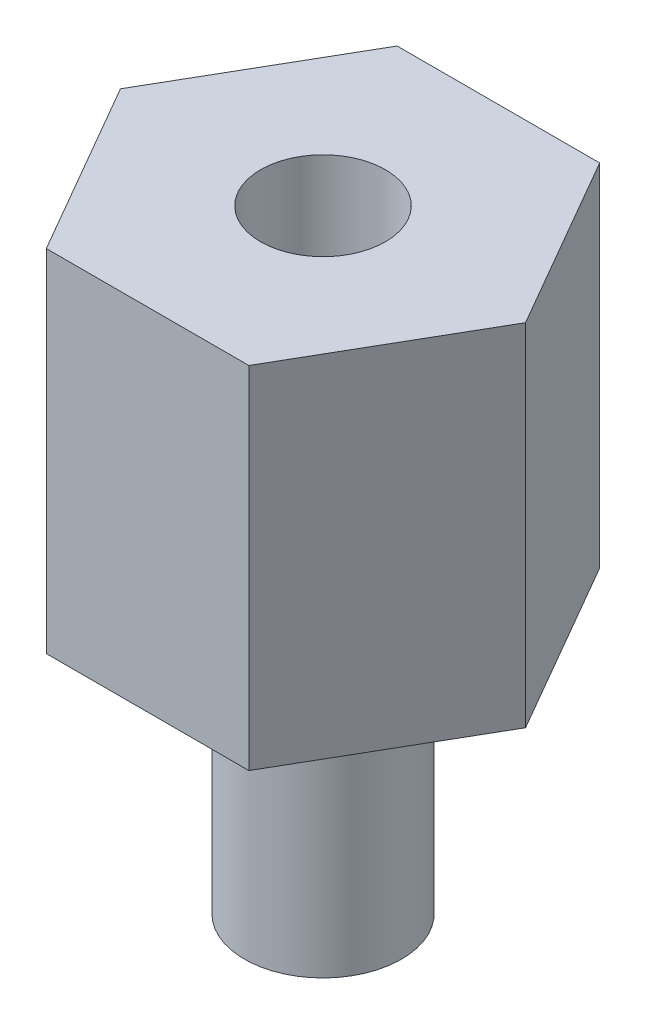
ISO-10303-21;
HEADER;
FILE_DESCRIPTION(('STEP AP214'),'2;1');
FILE_NAME('part.step','',(''),(''),'','','');
FILE_SCHEMA(('AUTOMOTIVE_DESIGN { 1 0 10303 214 1 1 1 1 }'));
ENDSEC;
DATA;
#1=APPLICATION_CONTEXT('core data for automotive mechanical design processes');
#2=APPLICATION_PROTOCOL_DEFINITION('international standard','automotive_design',2000,#1);
#3=PRODUCT_CONTEXT('',#1,'mechanical');
#4=PRODUCT('Part','Part','',(#3));
#5=PRODUCT_RELATED_PRODUCT_CATEGORY('part','',(#4));
#6=PRODUCT_DEFINITION_FORMATION('','',#4);
#7=PRODUCT_DEFINITION_CONTEXT('part definition',#1,'design');
#8=PRODUCT_DEFINITION('design','',#6,#7);
#9=PRODUCT_DEFINITION_SHAPE('','',#8);
#10=(LENGTH_UNIT() NAMED_UNIT(*) SI_UNIT(.MILLI.,.METRE.));
#11=(NAMED_UNIT(*) PLANE_ANGLE_UNIT() SI_UNIT($,.RADIAN.));
#12=(NAMED_UNIT(*) SI_UNIT($,.STERADIAN.) SOLID_ANGLE_UNIT());
#13=UNCERTAINTY_MEASURE_WITH_UNIT(LENGTH_MEASURE(1.E-05),#10,'distance_accuracy_value','');
#14=(GEOMETRIC_REPRESENTATION_CONTEXT(3) GLOBAL_UNCERTAINTY_ASSIGNED_CONTEXT((#13)) GLOBAL_UNIT_ASSIGNED_CONTEXT((#10,
#11,#12)) REPRESENTATION_CONTEXT('',''));
#15=CARTESIAN_POINT('',(0.,0.,0.));
#16=DIRECTION('',(0.,0.,1.));
#17=DIRECTION('',(1.,0.,0.));
#18=AXIS2_PLACEMENT_3D('',#15,#16,#17);
#19=CARTESIAN_POINT('',(1.83308710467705,0.,3.17500000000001));
#20=DIRECTION('',(0.,-1.,0.));
#21=DIRECTION('',(0.,0.,-1.));
#22=AXIS2_PLACEMENT_3D('',#19,#20,#21);
#23=PLANE('',#22);
#24=DIRECTION('',(0.5,0.,-0.866025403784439));
#25=VECTOR('',#24,1.);
#26=CARTESIAN_POINT('',(1.83308710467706,0.,3.17500000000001));
#27=LINE('',#26,#25);
#28=CARTESIAN_POINT('',(1.83308710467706,0.,3.17500000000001));
#29=VERTEX_POINT('',#28);
#30=CARTESIAN_POINT('',(3.66617420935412,0.,0.));
#31=VERTEX_POINT('',#30);
#32=EDGE_CURVE('E125',#29,#31,#27,.T.);
#33=ORIENTED_EDGE('',*,*,#32,.F.);
#34=DIRECTION('',(1.,0.,0.));
#35=VECTOR('',#34,1.);
#36=CARTESIAN_POINT('',(-1.83308710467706,0.,3.175));
#37=LINE('',#36,#35);
#38=CARTESIAN_POINT('',(-1.83308710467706,0.,3.175));
#39=VERTEX_POINT('',#38);
#40=EDGE_CURVE('E85',#39,#29,#37,.T.);
#41=ORIENTED_EDGE('',*,*,#40,.F.);
#42=DIRECTION('',(0.5,0.,0.866025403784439));
#43=VECTOR('',#42,1.);
#44=CARTESIAN_POINT('',(-3.66617420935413,0.,0.));
#45=LINE('',#44,#43);
#46=CARTESIAN_POINT('',(-3.66617420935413,0.,0.));
#47=VERTEX_POINT('',#46);
#48=EDGE_CURVE('E79',#47,#39,#45,.T.);
#49=ORIENTED_EDGE('',*,*,#48,.F.);
#50=DIRECTION('',(-0.499999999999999,0.,0.866025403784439));
#51=VECTOR('',#50,1.);
#52=CARTESIAN_POINT('',(-1.83308710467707,0.,-3.17500000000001));
#53=LINE('',#52,#51);
#54=CARTESIAN_POINT('',(-1.83308710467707,0.,-3.17500000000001));
#55=VERTEX_POINT('',#54);
#56=EDGE_CURVE('E115',#55,#47,#53,.T.);
#57=ORIENTED_EDGE('',*,*,#56,.F.);
#58=DIRECTION('',(-1.,0.,0.));
#59=VECTOR('',#58,1.);
#60=CARTESIAN_POINT('',(1.83308710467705,0.,-3.17500000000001));
#61=LINE('',#60,#59);
#62=CARTESIAN_POINT('',(1.83308710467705,0.,-3.17500000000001));
#63=VERTEX_POINT('',#62);
#64=EDGE_CURVE('E131',#63,#55,#61,.T.);
#65=ORIENTED_EDGE('',*,*,#64,.F.);
#66=DIRECTION('',(-0.500000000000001,0.,-0.866025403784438));
#67=VECTOR('',#66,1.);
#68=CARTESIAN_POINT('',(3.66617420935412,0.,0.));
#69=LINE('',#68,#67);
#70=EDGE_CURVE('E128',#31,#63,#69,.T.);
#71=ORIENTED_EDGE('',*,*,#70,.F.);
#72=EDGE_LOOP('',(#33,#41,#49,#57,#65,#71));
#73=FACE_BOUND('',#72,.T.);
#74=CARTESIAN_POINT('',(0.,0.,0.));
#75=DIRECTION('',(0.,-1.,0.));
#76=DIRECTION('',(0.,0.,-1.));
#77=AXIS2_PLACEMENT_3D('',#74,#75,#76);
#78=CIRCLE('',#77,1.4224);
#79=CARTESIAN_POINT('',(0.,0.,-1.4224));
#80=VERTEX_POINT('',#79);
#81=EDGE_CURVE('E191',#80,#80,#78,.T.);
#82=ORIENTED_EDGE('',*,*,#81,.F.);
#83=EDGE_LOOP('',(#82));
#84=FACE_BOUND('',#83,.T.);
#85=ADVANCED_FACE('F38',(#73,#84),#23,.T.);
#86=CARTESIAN_POINT('',(1.83308710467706,6.35000000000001,3.17500000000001));
#87=DIRECTION('',(-0.866025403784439,0.,-0.5));
#88=DIRECTION('',(-0.5,0.,0.866025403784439));
#89=AXIS2_PLACEMENT_3D('',#86,#87,#88);
#90=PLANE('',#89);
#91=ORIENTED_EDGE('',*,*,#32,.T.);
#92=DIRECTION('',(0.,-1.,0.));
#93=VECTOR('',#92,1.);
#94=CARTESIAN_POINT('',(3.66617420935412,6.35000000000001,0.));
#95=LINE('',#94,#93);
#96=CARTESIAN_POINT('',(3.66617420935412,6.35000000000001,0.));
#97=VERTEX_POINT('',#96);
#98=EDGE_CURVE('E11',#97,#31,#95,.T.);
#99=ORIENTED_EDGE('',*,*,#98,.F.);
#100=DIRECTION('',(0.5,0.,-0.866025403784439));
#101=VECTOR('',#100,1.);
#102=CARTESIAN_POINT('',(1.83308710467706,6.35000000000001,3.17500000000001));
#103=LINE('',#102,#101);
#104=CARTESIAN_POINT('',(1.83308710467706,6.35000000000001,3.17500000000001));
#105=VERTEX_POINT('',#104);
#106=EDGE_CURVE('E136',#105,#97,#103,.T.);
#107=ORIENTED_EDGE('',*,*,#106,.F.);
#108=DIRECTION('',(0.,-1.,0.));
#109=VECTOR('',#108,1.);
#110=CARTESIAN_POINT('',(1.83308710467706,6.35000000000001,3.17500000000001));
#111=LINE('',#110,#109);
#112=EDGE_CURVE('E121',#105,#29,#111,.T.);
#113=ORIENTED_EDGE('',*,*,#112,.T.);
#114=EDGE_LOOP('',(#91,#99,#107,#113));
#115=FACE_BOUND('',#114,.T.);
#116=ADVANCED_FACE('F40',(#115),#90,.F.);
#117=CARTESIAN_POINT('',(3.66617420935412,6.35000000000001,0.));
#118=DIRECTION('',(-0.866025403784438,0.,0.500000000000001));
#119=DIRECTION('',(0.500000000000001,0.,0.866025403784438));
#120=AXIS2_PLACEMENT_3D('',#117,#118,#119);
#121=PLANE('',#120);
#122=ORIENTED_EDGE('',*,*,#70,.T.);
#123=DIRECTION('',(0.,-1.,0.));
#124=VECTOR('',#123,1.);
#125=CARTESIAN_POINT('',(1.83308710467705,6.35000000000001,-3.17500000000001));
#126=LINE('',#125,#124);
#127=CARTESIAN_POINT('',(1.83308710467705,6.35000000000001,-3.17500000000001));
#128=VERTEX_POINT('',#127);
#129=EDGE_CURVE('E47',#128,#63,#126,.T.);
#130=ORIENTED_EDGE('',*,*,#129,.F.);
#131=DIRECTION('',(-0.500000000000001,0.,-0.866025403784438));
#132=VECTOR('',#131,1.);
#133=CARTESIAN_POINT('',(3.66617420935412,6.35000000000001,0.));
#134=LINE('',#133,#132);
#135=EDGE_CURVE('E93',#97,#128,#134,.T.);
#136=ORIENTED_EDGE('',*,*,#135,.F.);
#137=ORIENTED_EDGE('',*,*,#98,.T.);
#138=EDGE_LOOP('',(#122,#130,#136,#137));
#139=FACE_BOUND('',#138,.T.);
#140=ADVANCED_FACE('F165',(#139),#121,.F.);
#141=CARTESIAN_POINT('',(1.83308710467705,6.35000000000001,-3.17500000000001));
#142=DIRECTION('',(0.,0.,1.));
#143=DIRECTION('',(1.,0.,0.));
#144=AXIS2_PLACEMENT_3D('',#141,#142,#143);
#145=PLANE('',#144);
#146=ORIENTED_EDGE('',*,*,#64,.T.);
#147=DIRECTION('',(0.,-1.,0.));
#148=VECTOR('',#147,1.);
#149=CARTESIAN_POINT('',(-1.83308710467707,6.35000000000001,-3.17500000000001));
#150=LINE('',#149,#148);
#151=CARTESIAN_POINT('',(-1.83308710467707,6.35000000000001,-3.17500000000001));
#152=VERTEX_POINT('',#151);
#153=EDGE_CURVE('E116',#152,#55,#150,.T.);
#154=ORIENTED_EDGE('',*,*,#153,.F.);
#155=DIRECTION('',(-1.,0.,0.));
#156=VECTOR('',#155,1.);
#157=CARTESIAN_POINT('',(1.83308710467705,6.35000000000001,-3.17500000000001));
#158=LINE('',#157,#156);
#159=EDGE_CURVE('E107',#128,#152,#158,.T.);
#160=ORIENTED_EDGE('',*,*,#159,.F.);
#161=ORIENTED_EDGE('',*,*,#129,.T.);
#162=EDGE_LOOP('',(#146,#154,#160,#161));
#163=FACE_BOUND('',#162,.T.);
#164=ADVANCED_FACE('F142',(#163),#145,.F.);
#165=CARTESIAN_POINT('',(-1.83308710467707,6.35000000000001,-3.17500000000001));
#166=DIRECTION('',(0.866025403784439,0.,0.499999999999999));
#167=DIRECTION('',(0.499999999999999,0.,-0.866025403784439));
#168=AXIS2_PLACEMENT_3D('',#165,#166,#167);
#169=PLANE('',#168);
#170=ORIENTED_EDGE('',*,*,#56,.T.);
#171=DIRECTION('',(0.,-1.,0.));
#172=VECTOR('',#171,1.);
#173=CARTESIAN_POINT('',(-3.66617420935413,6.35000000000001,0.));
#174=LINE('',#173,#172);
#175=CARTESIAN_POINT('',(-3.66617420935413,6.35000000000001,0.));
#176=VERTEX_POINT('',#175);
#177=EDGE_CURVE('E112',#176,#47,#174,.T.);
#178=ORIENTED_EDGE('',*,*,#177,.F.);
#179=DIRECTION('',(-0.499999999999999,0.,0.866025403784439));
#180=VECTOR('',#179,1.);
#181=CARTESIAN_POINT('',(-1.83308710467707,6.35000000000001,-3.17500000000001));
#182=LINE('',#181,#180);
#183=EDGE_CURVE('E101',#152,#176,#182,.T.);
#184=ORIENTED_EDGE('',*,*,#183,.F.);
#185=ORIENTED_EDGE('',*,*,#153,.T.);
#186=EDGE_LOOP('',(#170,#178,#184,#185));
#187=FACE_BOUND('',#186,.T.);
#188=ADVANCED_FACE('F113',(#187),#169,.F.);
#189=CARTESIAN_POINT('',(-3.66617420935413,6.35000000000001,0.));
#190=DIRECTION('',(0.866025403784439,0.,-0.5));
#191=DIRECTION('',(-0.5,0.,-0.866025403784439));
#192=AXIS2_PLACEMENT_3D('',#189,#190,#191);
#193=PLANE('',#192);
#194=ORIENTED_EDGE('',*,*,#48,.T.);
#195=DIRECTION('',(0.,-1.,0.));
#196=VECTOR('',#195,1.);
#197=CARTESIAN_POINT('',(-1.83308710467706,6.35000000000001,3.175));
#198=LINE('',#197,#196);
#199=CARTESIAN_POINT('',(-1.83308710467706,6.35000000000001,3.175));
#200=VERTEX_POINT('',#199);
#201=EDGE_CURVE('E117',#200,#39,#198,.T.);
#202=ORIENTED_EDGE('',*,*,#201,.F.);
#203=DIRECTION('',(0.5,0.,0.866025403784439));
#204=VECTOR('',#203,1.);
#205=CARTESIAN_POINT('',(-3.66617420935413,6.35000000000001,0.));
#206=LINE('',#205,#204);
#207=EDGE_CURVE('E105',#176,#200,#206,.T.);
#208=ORIENTED_EDGE('',*,*,#207,.F.);
#209=ORIENTED_EDGE('',*,*,#177,.T.);
#210=EDGE_LOOP('',(#194,#202,#208,#209));
#211=FACE_BOUND('',#210,.T.);
#212=ADVANCED_FACE('F119',(#211),#193,.F.);
#213=CARTESIAN_POINT('',(-1.83308710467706,6.35000000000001,3.175));
#214=DIRECTION('',(0.,0.,-1.));
#215=DIRECTION('',(-1.,0.,0.));
#216=AXIS2_PLACEMENT_3D('',#213,#214,#215);
#217=PLANE('',#216);
#218=ORIENTED_EDGE('',*,*,#40,.T.);
#219=ORIENTED_EDGE('',*,*,#112,.F.);
#220=DIRECTION('',(1.,0.,0.));
#221=VECTOR('',#220,1.);
#222=CARTESIAN_POINT('',(-1.83308710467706,6.35000000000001,3.175));
#223=LINE('',#222,#221);
#224=EDGE_CURVE('E55',#200,#105,#223,.T.);
#225=ORIENTED_EDGE('',*,*,#224,.F.);
#226=ORIENTED_EDGE('',*,*,#201,.T.);
#227=EDGE_LOOP('',(#218,#219,#225,#226));
#228=FACE_BOUND('',#227,.T.);
#229=ADVANCED_FACE('F149',(#228),#217,.F.);
#230=CARTESIAN_POINT('',(1.83308710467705,6.35000000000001,3.17500000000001));
#231=DIRECTION('',(0.,-1.,0.));
#232=DIRECTION('',(0.,0.,-1.));
#233=AXIS2_PLACEMENT_3D('',#230,#231,#232);
#234=PLANE('',#233);
#235=CARTESIAN_POINT('',(0.,6.35000000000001,0.));
#236=DIRECTION('',(0.,1.,0.));
#237=DIRECTION('',(0.,0.,1.));
#238=AXIS2_PLACEMENT_3D('',#235,#236,#237);
#239=CIRCLE('',#238,1.1303);
#240=CARTESIAN_POINT('',(0.,6.35000000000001,1.1303));
#241=VERTEX_POINT('',#240);
#242=EDGE_CURVE('E188',#241,#241,#239,.T.);
#243=ORIENTED_EDGE('',*,*,#242,.F.);
#244=EDGE_LOOP('',(#243));
#245=FACE_BOUND('',#244,.T.);
#246=ORIENTED_EDGE('',*,*,#106,.T.);
#247=ORIENTED_EDGE('',*,*,#135,.T.);
#248=ORIENTED_EDGE('',*,*,#159,.T.);
#249=ORIENTED_EDGE('',*,*,#183,.T.);
#250=ORIENTED_EDGE('',*,*,#207,.T.);
#251=ORIENTED_EDGE('',*,*,#224,.T.);
#252=EDGE_LOOP('',(#246,#247,#248,#249,#250,#251));
#253=FACE_BOUND('',#252,.T.);
#254=ADVANCED_FACE('F103',(#245,#253),#234,.F.);
#255=CARTESIAN_POINT('',(0.,-4.7498,0.));
#256=DIRECTION('',(0.,1.,0.));
#257=DIRECTION('',(0.,0.,1.));
#258=AXIS2_PLACEMENT_3D('',#255,#256,#257);
#259=CYLINDRICAL_SURFACE('',#258,1.4224);
#260=CARTESIAN_POINT('',(0.,-4.7498,0.));
#261=DIRECTION('',(0.,-1.,0.));
#262=DIRECTION('',(0.,0.,-1.));
#263=AXIS2_PLACEMENT_3D('',#260,#261,#262);
#264=CIRCLE('',#263,1.4224);
#265=CARTESIAN_POINT('',(0.,-4.7498,-1.4224));
#266=VERTEX_POINT('',#265);
#267=EDGE_CURVE('E129',#266,#266,#264,.T.);
#268=ORIENTED_EDGE('',*,*,#267,.F.);
#269=EDGE_LOOP('',(#268));
#270=FACE_BOUND('',#269,.T.);
#271=ORIENTED_EDGE('',*,*,#81,.T.);
#272=EDGE_LOOP('',(#271));
#273=FACE_BOUND('',#272,.T.);
#274=ADVANCED_FACE('F156',(#270,#273),#259,.T.);
#275=CARTESIAN_POINT('',(0.,-4.7498,0.));
#276=DIRECTION('',(0.,-1.,0.));
#277=DIRECTION('',(0.,0.,-1.));
#278=AXIS2_PLACEMENT_3D('',#275,#276,#277);
#279=PLANE('',#278);
#280=ORIENTED_EDGE('',*,*,#267,.T.);
#281=EDGE_LOOP('',(#280));
#282=FACE_BOUND('',#281,.T.);
#283=ADVANCED_FACE('F169',(#282),#279,.T.);
#284=CARTESIAN_POINT('',(0.,6.35000000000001,0.));
#285=DIRECTION('',(0.,1.,0.));
#286=DIRECTION('',(0.,0.,1.));
#287=AXIS2_PLACEMENT_3D('',#284,#285,#286);
#288=CYLINDRICAL_SURFACE('',#287,1.1303);
#289=CARTESIAN_POINT('',(0.,-2.51459999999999,0.));
#290=DIRECTION('',(0.,1.,0.));
#291=DIRECTION('',(0.,0.,1.));
#292=AXIS2_PLACEMENT_3D('',#289,#290,#291);
#293=CIRCLE('',#292,1.1303);
#294=CARTESIAN_POINT('',(0.,-2.51459999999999,1.1303));
#295=VERTEX_POINT('',#294);
#296=EDGE_CURVE('E187',#295,#295,#293,.T.);
#297=ORIENTED_EDGE('',*,*,#296,.F.);
#298=EDGE_LOOP('',(#297));
#299=FACE_BOUND('',#298,.T.);
#300=ORIENTED_EDGE('',*,*,#242,.T.);
#301=EDGE_LOOP('',(#300));
#302=FACE_BOUND('',#301,.T.);
#303=ADVANCED_FACE('F173',(#299,#302),#288,.F.);
#304=CARTESIAN_POINT('',(0.,-2.51459999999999,0.));
#305=DIRECTION('',(0.,1.,0.));
#306=DIRECTION('',(0.,0.,1.));
#307=AXIS2_PLACEMENT_3D('',#304,#305,#306);
#308=CONICAL_SURFACE('',#307,1.1303,1.02974425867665);
#309=CARTESIAN_POINT('',(0.,-3.19375275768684,0.));
#310=VERTEX_POINT('',#309);
#311=VERTEX_LOOP('',#310);
#312=FACE_BOUND('',#311,.T.);
#313=ORIENTED_EDGE('',*,*,#296,.T.);
#314=EDGE_LOOP('',(#313));
#315=FACE_BOUND('',#314,.T.);
#316=ADVANCED_FACE('F177',(#312,#315),#308,.F.);
#317=CLOSED_SHELL('',(#85,#116,#140,#164,#188,#212,#229,#254,#274,#283,#303,#316));
#318=MANIFOLD_SOLID_BREP('B2',#317);
#319=ADVANCED_BREP_SHAPE_REPRESENTATION('',(#18,#318),#14);
#320=SHAPE_DEFINITION_REPRESENTATION(#9,#319);
ENDSEC;
END-ISO-10303-21;
